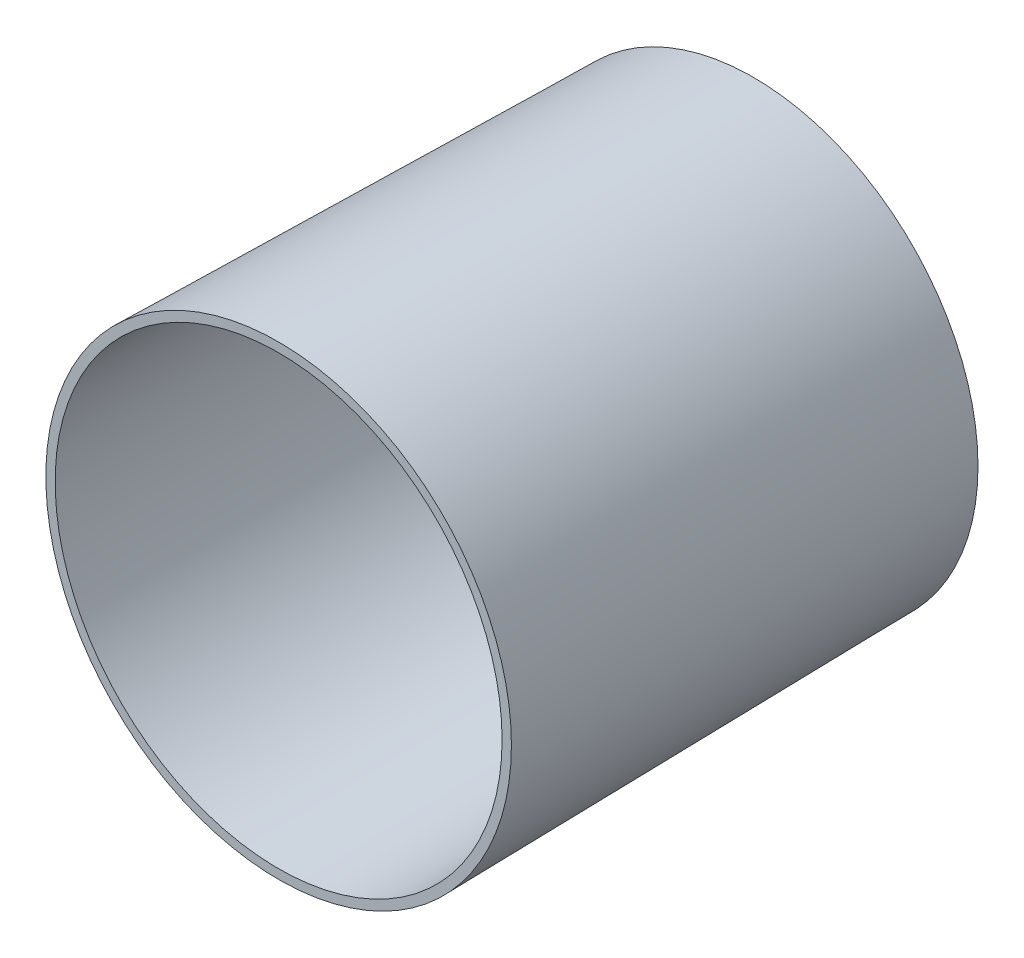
ISO-10303-21;
HEADER;
FILE_DESCRIPTION(('STEP AP214'),'2;1');
FILE_NAME('part.step','',(''),(''),'','','');
FILE_SCHEMA(('AUTOMOTIVE_DESIGN { 1 0 10303 214 1 1 1 1 }'));
ENDSEC;
DATA;
#1=APPLICATION_CONTEXT('core data for automotive mechanical design processes');
#2=APPLICATION_PROTOCOL_DEFINITION('international standard','automotive_design',2000,#1);
#3=PRODUCT_CONTEXT('',#1,'mechanical');
#4=PRODUCT('Part','Part','',(#3));
#5=PRODUCT_RELATED_PRODUCT_CATEGORY('part','',(#4));
#6=PRODUCT_DEFINITION_FORMATION('','',#4);
#7=PRODUCT_DEFINITION_CONTEXT('part definition',#1,'design');
#8=PRODUCT_DEFINITION('design','',#6,#7);
#9=PRODUCT_DEFINITION_SHAPE('','',#8);
#10=(LENGTH_UNIT() NAMED_UNIT(*) SI_UNIT(.MILLI.,.METRE.));
#11=(NAMED_UNIT(*) PLANE_ANGLE_UNIT() SI_UNIT($,.RADIAN.));
#12=(NAMED_UNIT(*) SI_UNIT($,.STERADIAN.) SOLID_ANGLE_UNIT());
#13=UNCERTAINTY_MEASURE_WITH_UNIT(LENGTH_MEASURE(1.E-05),#10,'distance_accuracy_value','');
#14=(GEOMETRIC_REPRESENTATION_CONTEXT(3) GLOBAL_UNCERTAINTY_ASSIGNED_CONTEXT((#13)) GLOBAL_UNIT_ASSIGNED_CONTEXT((#10,
#11,#12)) REPRESENTATION_CONTEXT('',''));
#15=CARTESIAN_POINT('',(0.,0.,0.));
#16=DIRECTION('',(0.,0.,1.));
#17=DIRECTION('',(1.,0.,0.));
#18=AXIS2_PLACEMENT_3D('',#15,#16,#17);
#19=CARTESIAN_POINT('',(-56.0001523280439,0.,50.));
#20=DIRECTION('',(0.,0.,1.));
#21=DIRECTION('',(1.,0.,0.));
#22=AXIS2_PLACEMENT_3D('',#19,#20,#21);
#23=PLANE('',#22);
#24=CARTESIAN_POINT('',(-80.,0.,50.));
#25=DIRECTION('',(0.,0.,1.));
#26=DIRECTION('',(1.,0.,0.));
#27=AXIS2_PLACEMENT_3D('',#24,#25,#26);
#28=CIRCLE('',#27,25.);
#29=CARTESIAN_POINT('',(-55.,0.,50.));
#30=VERTEX_POINT('',#29);
#31=EDGE_CURVE('E56',#30,#30,#28,.T.);
#32=ORIENTED_EDGE('',*,*,#31,.T.);
#33=EDGE_LOOP('',(#32));
#34=FACE_BOUND('',#33,.T.);
#35=CARTESIAN_POINT('',(-80.,0.,50.));
#36=DIRECTION('',(0.,0.,1.));
#37=DIRECTION('',(1.,0.,0.));
#38=AXIS2_PLACEMENT_3D('',#35,#36,#37);
#39=CIRCLE('',#38,23.9998476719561);
#40=CARTESIAN_POINT('',(-56.0001523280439,0.,50.));
#41=VERTEX_POINT('',#40);
#42=EDGE_CURVE('E41',#41,#41,#39,.T.);
#43=ORIENTED_EDGE('',*,*,#42,.F.);
#44=EDGE_LOOP('',(#43));
#45=FACE_BOUND('',#44,.T.);
#46=ADVANCED_FACE('F30',(#34,#45),#23,.T.);
#47=CARTESIAN_POINT('',(-80.,0.,1.));
#48=DIRECTION('',(0.,0.,1.));
#49=DIRECTION('',(1.,0.,0.));
#50=AXIS2_PLACEMENT_3D('',#47,#48,#49);
#51=CONICAL_SURFACE('',#50,23.1445494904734,0.0174532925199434);
#52=CARTESIAN_POINT('',(-80.,0.,1.98254759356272));
#53=DIRECTION('',(0.,0.,1.));
#54=DIRECTION('',(1.,0.,0.));
#55=AXIS2_PLACEMENT_3D('',#52,#53,#54);
#56=CIRCLE('',#55,23.1616999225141);
#57=CARTESIAN_POINT('',(-56.8383000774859,0.,1.98254759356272));
#58=VERTEX_POINT('',#57);
#59=EDGE_CURVE('E10',#58,#58,#56,.F.);
#60=ORIENTED_EDGE('',*,*,#59,.T.);
#61=EDGE_LOOP('',(#60));
#62=FACE_BOUND('',#61,.T.);
#63=ORIENTED_EDGE('',*,*,#42,.T.);
#64=EDGE_LOOP('',(#63));
#65=FACE_BOUND('',#64,.T.);
#66=ADVANCED_FACE('F76',(#62,#65),#51,.F.);
#67=CARTESIAN_POINT('',(-80.,0.,1.));
#68=DIRECTION('',(0.,0.,1.));
#69=DIRECTION('',(1.,0.,0.));
#70=AXIS2_PLACEMENT_3D('',#67,#68,#69);
#71=PLANE('',#70);
#72=CARTESIAN_POINT('',(-80.,0.,1.));
#73=DIRECTION('',(0.,0.,1.));
#74=DIRECTION('',(1.,0.,0.));
#75=AXIS2_PLACEMENT_3D('',#72,#73,#74);
#76=CIRCLE('',#75,22.1618522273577);
#77=CARTESIAN_POINT('',(-57.8381477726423,0.,1.));
#78=VERTEX_POINT('',#77);
#79=EDGE_CURVE('E37',#78,#78,#76,.T.);
#80=ORIENTED_EDGE('',*,*,#79,.T.);
#81=EDGE_LOOP('',(#80));
#82=FACE_BOUND('',#81,.T.);
#83=ADVANCED_FACE('F80',(#82),#71,.T.);
#84=CARTESIAN_POINT('',(-56.881480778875,0.,0.));
#85=DIRECTION('',(0.,0.,-1.));
#86=DIRECTION('',(-1.,0.,0.));
#87=AXIS2_PLACEMENT_3D('',#84,#85,#86);
#88=PLANE('',#87);
#89=CARTESIAN_POINT('',(-80.,0.,0.));
#90=DIRECTION('',(0.,0.,1.));
#91=DIRECTION('',(1.,0.,0.));
#92=AXIS2_PLACEMENT_3D('',#89,#90,#91);
#93=CIRCLE('',#92,23.118519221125);
#94=CARTESIAN_POINT('',(-56.881480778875,0.,0.));
#95=VERTEX_POINT('',#94);
#96=EDGE_CURVE('E45',#95,#95,#93,.T.);
#97=ORIENTED_EDGE('',*,*,#96,.F.);
#98=EDGE_LOOP('',(#97));
#99=FACE_BOUND('',#98,.T.);
#100=ADVANCED_FACE('F85',(#99),#88,.T.);
#101=CARTESIAN_POINT('',(-80.,0.,35.8455850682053));
#102=DIRECTION('',(0.,0.,1.));
#103=DIRECTION('',(1.,0.,0.));
#104=AXIS2_PLACEMENT_3D('',#101,#102,#103);
#105=CYLINDRICAL_SURFACE('',#104,23.118519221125);
#106=ORIENTED_EDGE('',*,*,#96,.T.);
#107=EDGE_LOOP('',(#106));
#108=FACE_BOUND('',#107,.T.);
#109=CARTESIAN_POINT('',(-80.,0.,-1.));
#110=DIRECTION('',(0.,0.,1.));
#111=DIRECTION('',(1.,0.,0.));
#112=AXIS2_PLACEMENT_3D('',#109,#110,#111);
#113=CIRCLE('',#112,23.118519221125);
#114=CARTESIAN_POINT('',(-56.881480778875,0.,-1.));
#115=VERTEX_POINT('',#114);
#116=EDGE_CURVE('E50',#115,#115,#113,.T.);
#117=ORIENTED_EDGE('',*,*,#116,.F.);
#118=EDGE_LOOP('',(#117));
#119=FACE_BOUND('',#118,.T.);
#120=ADVANCED_FACE('F72',(#108,#119),#105,.F.);
#121=CARTESIAN_POINT('',(-55.8902083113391,0.,-1.));
#122=DIRECTION('',(0.,0.,-1.));
#123=DIRECTION('',(-1.,0.,0.));
#124=AXIS2_PLACEMENT_3D('',#121,#122,#123);
#125=PLANE('',#124);
#126=ORIENTED_EDGE('',*,*,#116,.T.);
#127=EDGE_LOOP('',(#126));
#128=FACE_BOUND('',#127,.T.);
#129=CARTESIAN_POINT('',(-80.,0.,-1.));
#130=DIRECTION('',(0.,0.,1.));
#131=DIRECTION('',(1.,0.,0.));
#132=AXIS2_PLACEMENT_3D('',#129,#130,#131);
#133=CIRCLE('',#132,24.1097916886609);
#134=CARTESIAN_POINT('',(-55.8902083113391,0.,-1.));
#135=VERTEX_POINT('',#134);
#136=EDGE_CURVE('E53',#135,#135,#133,.T.);
#137=ORIENTED_EDGE('',*,*,#136,.F.);
#138=EDGE_LOOP('',(#137));
#139=FACE_BOUND('',#138,.T.);
#140=ADVANCED_FACE('F64',(#128,#139),#125,.T.);
#141=CARTESIAN_POINT('',(-80.,0.,50.));
#142=DIRECTION('',(0.,0.,1.));
#143=DIRECTION('',(1.,0.,0.));
#144=AXIS2_PLACEMENT_3D('',#141,#142,#143);
#145=CONICAL_SURFACE('',#144,25.,0.0174532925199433);
#146=ORIENTED_EDGE('',*,*,#136,.T.);
#147=EDGE_LOOP('',(#146));
#148=FACE_BOUND('',#147,.T.);
#149=ORIENTED_EDGE('',*,*,#31,.F.);
#150=EDGE_LOOP('',(#149));
#151=FACE_BOUND('',#150,.T.);
#152=ADVANCED_FACE('F62',(#148,#151),#145,.T.);
#153=CARTESIAN_POINT('',(-80.,0.,2.));
#154=DIRECTION('',(0.,0.,1.));
#155=DIRECTION('',(1.,0.,0.));
#156=AXIS2_PLACEMENT_3D('',#153,#154,#155);
#157=TOROIDAL_SURFACE('',#156,22.1618522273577,1.);
#158=ORIENTED_EDGE('',*,*,#59,.F.);
#159=EDGE_LOOP('',(#158));
#160=FACE_BOUND('',#159,.T.);
#161=ORIENTED_EDGE('',*,*,#79,.F.);
#162=EDGE_LOOP('',(#161));
#163=FACE_BOUND('',#162,.T.);
#164=ADVANCED_FACE('F32',(#160,#163),#157,.F.);
#165=CLOSED_SHELL('',(#46,#66,#83,#100,#120,#140,#152,#164));
#166=MANIFOLD_SOLID_BREP('B2',#165);
#167=ADVANCED_BREP_SHAPE_REPRESENTATION('',(#18,#166),#14);
#168=SHAPE_DEFINITION_REPRESENTATION(#9,#167);
ENDSEC;
END-ISO-10303-21;
